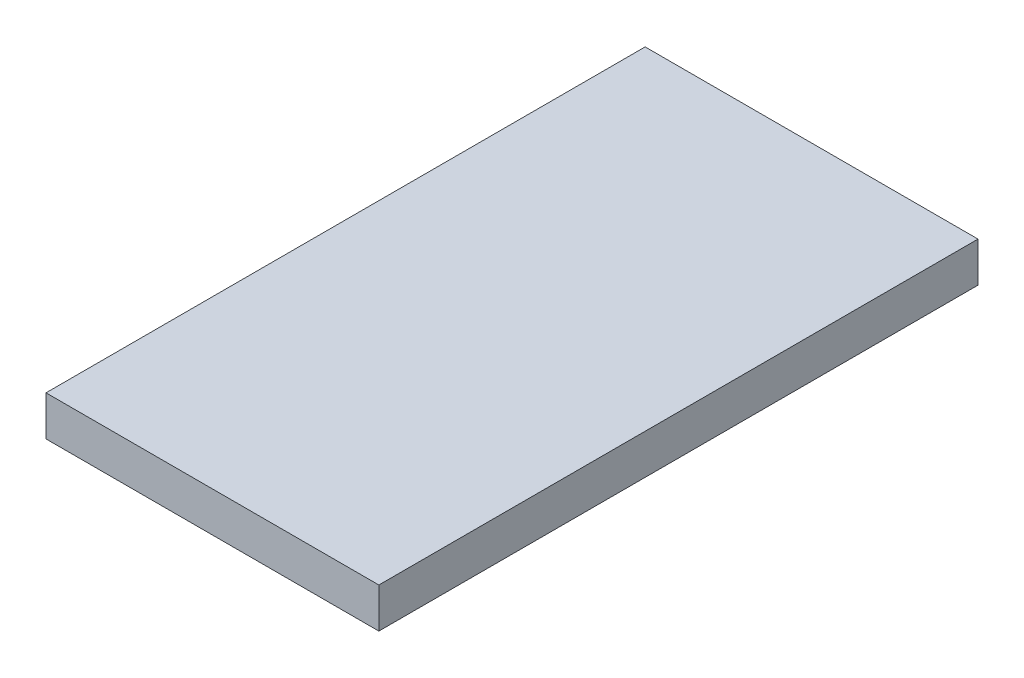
from build123d import *

# Parameters (mm, degrees)
SKIZZE1_W                       = 50
SKIZZE1_H                       = 90
AUFSATZ_LINEAR_AUSTRAGEN1_DEPTH = 6


with BuildPart() as part:
    # Skizze1 → Aufsatz-Linear austragen1 (new body)
    with BuildSketch(Plane(origin=(0, 0, 0), x_dir=(1, 0, 0), z_dir=(0, 1, 0))):
        with Locations((-25, 45)):
            Rectangle(SKIZZE1_W, SKIZZE1_H)
    extrude(amount=AUFSATZ_LINEAR_AUSTRAGEN1_DEPTH)


solid = part.part
